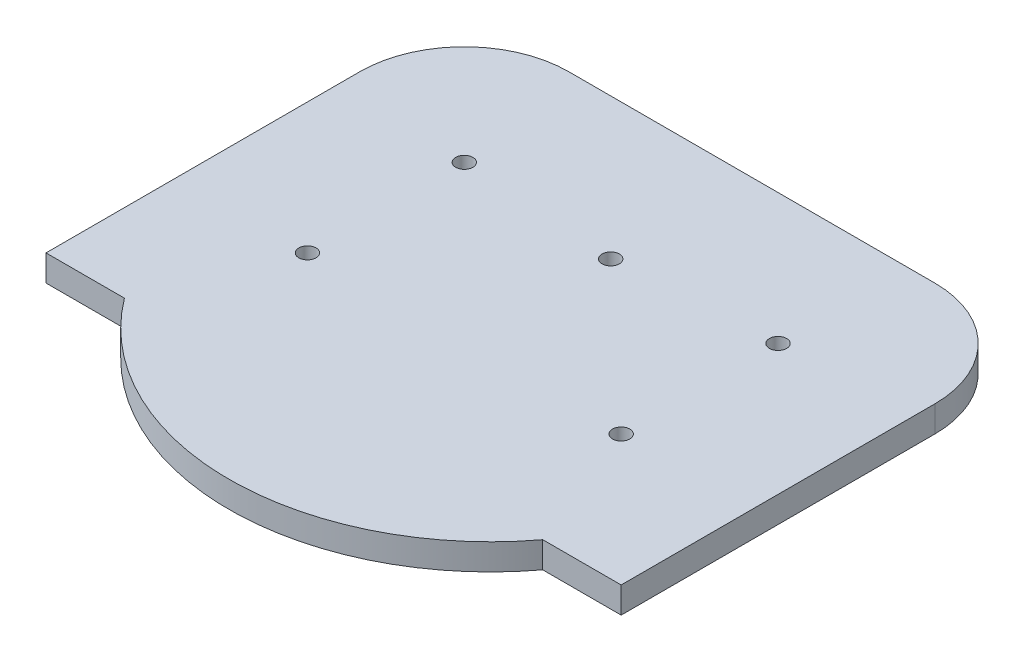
ISO-10303-21;
HEADER;
FILE_DESCRIPTION(('STEP AP214'),'2;1');
FILE_NAME('part.step','',(''),(''),'','','');
FILE_SCHEMA(('AUTOMOTIVE_DESIGN { 1 0 10303 214 1 1 1 1 }'));
ENDSEC;
DATA;
#1=APPLICATION_CONTEXT('core data for automotive mechanical design processes');
#2=APPLICATION_PROTOCOL_DEFINITION('international standard','automotive_design',2000,#1);
#3=PRODUCT_CONTEXT('',#1,'mechanical');
#4=PRODUCT('Part','Part','',(#3));
#5=PRODUCT_RELATED_PRODUCT_CATEGORY('part','',(#4));
#6=PRODUCT_DEFINITION_FORMATION('','',#4);
#7=PRODUCT_DEFINITION_CONTEXT('part definition',#1,'design');
#8=PRODUCT_DEFINITION('design','',#6,#7);
#9=PRODUCT_DEFINITION_SHAPE('','',#8);
#10=(LENGTH_UNIT() NAMED_UNIT(*) SI_UNIT(.MILLI.,.METRE.));
#11=(NAMED_UNIT(*) PLANE_ANGLE_UNIT() SI_UNIT($,.RADIAN.));
#12=(NAMED_UNIT(*) SI_UNIT($,.STERADIAN.) SOLID_ANGLE_UNIT());
#13=UNCERTAINTY_MEASURE_WITH_UNIT(LENGTH_MEASURE(1.E-05),#10,'distance_accuracy_value','');
#14=(GEOMETRIC_REPRESENTATION_CONTEXT(3) GLOBAL_UNCERTAINTY_ASSIGNED_CONTEXT((#13)) GLOBAL_UNIT_ASSIGNED_CONTEXT((#10,
#11,#12)) REPRESENTATION_CONTEXT('',''));
#15=CARTESIAN_POINT('',(0.,0.,0.));
#16=DIRECTION('',(0.,0.,1.));
#17=DIRECTION('',(1.,0.,0.));
#18=AXIS2_PLACEMENT_3D('',#15,#16,#17);
#19=CARTESIAN_POINT('',(20.,0.,-60.));
#20=DIRECTION('',(0.,-1.,0.));
#21=DIRECTION('',(0.,0.,-1.));
#22=AXIS2_PLACEMENT_3D('',#19,#20,#21);
#23=PLANE('',#22);
#24=CARTESIAN_POINT('',(55.,0.,-53.));
#25=DIRECTION('',(0.,1.,0.));
#26=DIRECTION('',(0.,0.,1.));
#27=AXIS2_PLACEMENT_3D('',#24,#25,#26);
#28=CIRCLE('',#27,1.65);
#29=CARTESIAN_POINT('',(55.,0.,-51.35));
#30=VERTEX_POINT('',#29);
#31=EDGE_CURVE('E194',#30,#30,#28,.T.);
#32=ORIENTED_EDGE('',*,*,#31,.T.);
#33=EDGE_LOOP('',(#32));
#34=FACE_BOUND('',#33,.T.);
#35=CARTESIAN_POINT('',(25.,0.,-25.));
#36=DIRECTION('',(0.,1.,0.));
#37=DIRECTION('',(0.,0.,1.));
#38=AXIS2_PLACEMENT_3D('',#35,#36,#37);
#39=CIRCLE('',#38,1.65);
#40=CARTESIAN_POINT('',(25.,0.,-23.35));
#41=VERTEX_POINT('',#40);
#42=EDGE_CURVE('E133',#41,#41,#39,.T.);
#43=ORIENTED_EDGE('',*,*,#42,.T.);
#44=EDGE_LOOP('',(#43));
#45=FACE_BOUND('',#44,.T.);
#46=DIRECTION('',(0.,0.,1.));
#47=VECTOR('',#46,1.);
#48=CARTESIAN_POINT('',(0.,0.,0.));
#49=LINE('',#48,#47);
#50=CARTESIAN_POINT('',(0.,0.,-59.9999999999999));
#51=VERTEX_POINT('',#50);
#52=CARTESIAN_POINT('',(0.,0.,0.));
#53=VERTEX_POINT('',#52);
#54=EDGE_CURVE('E129',#51,#53,#49,.T.);
#55=ORIENTED_EDGE('',*,*,#54,.F.);
#56=CARTESIAN_POINT('',(20.,0.,-60.));
#57=DIRECTION('',(0.,1.,0.));
#58=DIRECTION('',(0.,0.,-1.));
#59=AXIS2_PLACEMENT_3D('',#56,#57,#58);
#60=CIRCLE('',#59,20.);
#61=CARTESIAN_POINT('',(20.0000000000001,0.,-80.));
#62=VERTEX_POINT('',#61);
#63=EDGE_CURVE('E83',#62,#51,#60,.T.);
#64=ORIENTED_EDGE('',*,*,#63,.F.);
#65=DIRECTION('',(-1.,0.,0.));
#66=VECTOR('',#65,1.);
#67=CARTESIAN_POINT('',(20.0000000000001,0.,-80.));
#68=LINE('',#67,#66);
#69=CARTESIAN_POINT('',(89.9999999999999,0.,-80.));
#70=VERTEX_POINT('',#69);
#71=EDGE_CURVE('E77',#70,#62,#68,.T.);
#72=ORIENTED_EDGE('',*,*,#71,.F.);
#73=CARTESIAN_POINT('',(90.,0.,-60.));
#74=DIRECTION('',(0.,1.,0.));
#75=DIRECTION('',(0.,0.,1.));
#76=AXIS2_PLACEMENT_3D('',#73,#74,#75);
#77=CIRCLE('',#76,20.);
#78=CARTESIAN_POINT('',(110.,0.,-59.9999999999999));
#79=VERTEX_POINT('',#78);
#80=EDGE_CURVE('E119',#79,#70,#77,.T.);
#81=ORIENTED_EDGE('',*,*,#80,.F.);
#82=DIRECTION('',(0.,0.,-1.));
#83=VECTOR('',#82,1.);
#84=CARTESIAN_POINT('',(110.,0.,0.));
#85=LINE('',#84,#83);
#86=CARTESIAN_POINT('',(110.,0.,0.));
#87=VERTEX_POINT('',#86);
#88=EDGE_CURVE('E139',#87,#79,#85,.T.);
#89=ORIENTED_EDGE('',*,*,#88,.F.);
#90=DIRECTION('',(1.,0.,0.));
#91=VECTOR('',#90,1.);
#92=CARTESIAN_POINT('',(95.,0.,0.));
#93=LINE('',#92,#91);
#94=CARTESIAN_POINT('',(95.,0.,0.));
#95=VERTEX_POINT('',#94);
#96=EDGE_CURVE('E137',#95,#87,#93,.T.);
#97=ORIENTED_EDGE('',*,*,#96,.F.);
#98=CARTESIAN_POINT('',(55.,0.,-30.));
#99=DIRECTION('',(0.,1.,0.));
#100=DIRECTION('',(0.,0.,1.));
#101=AXIS2_PLACEMENT_3D('',#98,#99,#100);
#102=CIRCLE('',#101,50.);
#103=CARTESIAN_POINT('',(15.,0.,0.));
#104=VERTEX_POINT('',#103);
#105=EDGE_CURVE('E135',#104,#95,#102,.T.);
#106=ORIENTED_EDGE('',*,*,#105,.F.);
#107=DIRECTION('',(1.,0.,0.));
#108=VECTOR('',#107,1.);
#109=CARTESIAN_POINT('',(0.,0.,0.));
#110=LINE('',#109,#108);
#111=EDGE_CURVE('E132',#53,#104,#110,.T.);
#112=ORIENTED_EDGE('',*,*,#111,.F.);
#113=EDGE_LOOP('',(#55,#64,#72,#81,#89,#97,#106,#112));
#114=FACE_BOUND('',#113,.T.);
#115=CARTESIAN_POINT('',(85.,0.,-25.));
#116=DIRECTION('',(0.,1.,0.));
#117=DIRECTION('',(0.,0.,1.));
#118=AXIS2_PLACEMENT_3D('',#115,#116,#117);
#119=CIRCLE('',#118,1.65);
#120=CARTESIAN_POINT('',(85.,0.,-23.35));
#121=VERTEX_POINT('',#120);
#122=EDGE_CURVE('E182',#121,#121,#119,.T.);
#123=ORIENTED_EDGE('',*,*,#122,.T.);
#124=EDGE_LOOP('',(#123));
#125=FACE_BOUND('',#124,.T.);
#126=CARTESIAN_POINT('',(85.,0.,-55.));
#127=DIRECTION('',(0.,1.,0.));
#128=DIRECTION('',(0.,0.,1.));
#129=AXIS2_PLACEMENT_3D('',#126,#127,#128);
#130=CIRCLE('',#129,1.65);
#131=CARTESIAN_POINT('',(85.,0.,-53.35));
#132=VERTEX_POINT('',#131);
#133=EDGE_CURVE('E188',#132,#132,#130,.T.);
#134=ORIENTED_EDGE('',*,*,#133,.T.);
#135=EDGE_LOOP('',(#134));
#136=FACE_BOUND('',#135,.T.);
#137=CARTESIAN_POINT('',(25.,0.,-55.));
#138=DIRECTION('',(0.,1.,0.));
#139=DIRECTION('',(0.,0.,1.));
#140=AXIS2_PLACEMENT_3D('',#137,#138,#139);
#141=CIRCLE('',#140,1.65);
#142=CARTESIAN_POINT('',(25.,0.,-53.35));
#143=VERTEX_POINT('',#142);
#144=EDGE_CURVE('E200',#143,#143,#141,.T.);
#145=ORIENTED_EDGE('',*,*,#144,.T.);
#146=EDGE_LOOP('',(#145));
#147=FACE_BOUND('',#146,.T.);
#148=ADVANCED_FACE('F31',(#34,#45,#114,#125,#136,#147),#23,.T.);
#149=CARTESIAN_POINT('',(20.,5.,-60.));
#150=DIRECTION('',(0.,-1.,0.));
#151=DIRECTION('',(0.,0.,-1.));
#152=AXIS2_PLACEMENT_3D('',#149,#150,#151);
#153=PLANE('',#152);
#154=CARTESIAN_POINT('',(85.,5.,-55.));
#155=DIRECTION('',(0.,1.,0.));
#156=DIRECTION('',(0.,0.,1.));
#157=AXIS2_PLACEMENT_3D('',#154,#155,#156);
#158=CIRCLE('',#157,1.65);
#159=CARTESIAN_POINT('',(85.,5.,-53.35));
#160=VERTEX_POINT('',#159);
#161=EDGE_CURVE('E191',#160,#160,#158,.T.);
#162=ORIENTED_EDGE('',*,*,#161,.F.);
#163=EDGE_LOOP('',(#162));
#164=FACE_BOUND('',#163,.T.);
#165=CARTESIAN_POINT('',(85.,5.,-25.));
#166=DIRECTION('',(0.,1.,0.));
#167=DIRECTION('',(0.,0.,1.));
#168=AXIS2_PLACEMENT_3D('',#165,#166,#167);
#169=CIRCLE('',#168,1.65);
#170=CARTESIAN_POINT('',(85.,5.,-23.35));
#171=VERTEX_POINT('',#170);
#172=EDGE_CURVE('E185',#171,#171,#169,.T.);
#173=ORIENTED_EDGE('',*,*,#172,.F.);
#174=EDGE_LOOP('',(#173));
#175=FACE_BOUND('',#174,.T.);
#176=DIRECTION('',(0.,0.,1.));
#177=VECTOR('',#176,1.);
#178=CARTESIAN_POINT('',(0.,5.,0.));
#179=LINE('',#178,#177);
#180=CARTESIAN_POINT('',(0.,5.,-59.9999999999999));
#181=VERTEX_POINT('',#180);
#182=CARTESIAN_POINT('',(0.,5.,0.));
#183=VERTEX_POINT('',#182);
#184=EDGE_CURVE('E144',#181,#183,#179,.T.);
#185=ORIENTED_EDGE('',*,*,#184,.T.);
#186=DIRECTION('',(1.,0.,0.));
#187=VECTOR('',#186,1.);
#188=CARTESIAN_POINT('',(0.,5.,0.));
#189=LINE('',#188,#187);
#190=CARTESIAN_POINT('',(15.,5.,0.));
#191=VERTEX_POINT('',#190);
#192=EDGE_CURVE('E91',#183,#191,#189,.T.);
#193=ORIENTED_EDGE('',*,*,#192,.T.);
#194=CARTESIAN_POINT('',(55.,5.,-30.));
#195=DIRECTION('',(0.,1.,0.));
#196=DIRECTION('',(0.,0.,1.));
#197=AXIS2_PLACEMENT_3D('',#194,#195,#196);
#198=CIRCLE('',#197,50.);
#199=CARTESIAN_POINT('',(95.,5.,0.));
#200=VERTEX_POINT('',#199);
#201=EDGE_CURVE('E159',#191,#200,#198,.T.);
#202=ORIENTED_EDGE('',*,*,#201,.T.);
#203=DIRECTION('',(1.,0.,0.));
#204=VECTOR('',#203,1.);
#205=CARTESIAN_POINT('',(95.,5.,0.));
#206=LINE('',#205,#204);
#207=CARTESIAN_POINT('',(110.,5.,0.));
#208=VERTEX_POINT('',#207);
#209=EDGE_CURVE('E171',#200,#208,#206,.T.);
#210=ORIENTED_EDGE('',*,*,#209,.T.);
#211=DIRECTION('',(0.,0.,-1.));
#212=VECTOR('',#211,1.);
#213=CARTESIAN_POINT('',(110.,5.,0.));
#214=LINE('',#213,#212);
#215=CARTESIAN_POINT('',(110.,5.,-59.9999999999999));
#216=VERTEX_POINT('',#215);
#217=EDGE_CURVE('E111',#208,#216,#214,.T.);
#218=ORIENTED_EDGE('',*,*,#217,.T.);
#219=CARTESIAN_POINT('',(90.,5.,-60.));
#220=DIRECTION('',(0.,1.,0.));
#221=DIRECTION('',(0.,0.,1.));
#222=AXIS2_PLACEMENT_3D('',#219,#220,#221);
#223=CIRCLE('',#222,20.);
#224=CARTESIAN_POINT('',(89.9999999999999,5.,-80.));
#225=VERTEX_POINT('',#224);
#226=EDGE_CURVE('E104',#216,#225,#223,.T.);
#227=ORIENTED_EDGE('',*,*,#226,.T.);
#228=DIRECTION('',(-1.,0.,0.));
#229=VECTOR('',#228,1.);
#230=CARTESIAN_POINT('',(20.0000000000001,5.,-80.));
#231=LINE('',#230,#229);
#232=CARTESIAN_POINT('',(20.0000000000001,5.,-80.));
#233=VERTEX_POINT('',#232);
#234=EDGE_CURVE('E109',#225,#233,#231,.T.);
#235=ORIENTED_EDGE('',*,*,#234,.T.);
#236=CARTESIAN_POINT('',(20.,5.,-60.));
#237=DIRECTION('',(0.,1.,0.));
#238=DIRECTION('',(0.,0.,-1.));
#239=AXIS2_PLACEMENT_3D('',#236,#237,#238);
#240=CIRCLE('',#239,20.);
#241=EDGE_CURVE('E48',#233,#181,#240,.T.);
#242=ORIENTED_EDGE('',*,*,#241,.T.);
#243=EDGE_LOOP('',(#185,#193,#202,#210,#218,#227,#235,#242));
#244=FACE_BOUND('',#243,.T.);
#245=CARTESIAN_POINT('',(25.,5.,-25.));
#246=DIRECTION('',(0.,1.,0.));
#247=DIRECTION('',(0.,0.,1.));
#248=AXIS2_PLACEMENT_3D('',#245,#246,#247);
#249=CIRCLE('',#248,1.65);
#250=CARTESIAN_POINT('',(25.,5.,-23.35));
#251=VERTEX_POINT('',#250);
#252=EDGE_CURVE('E179',#251,#251,#249,.T.);
#253=ORIENTED_EDGE('',*,*,#252,.F.);
#254=EDGE_LOOP('',(#253));
#255=FACE_BOUND('',#254,.T.);
#256=CARTESIAN_POINT('',(55.,5.,-53.));
#257=DIRECTION('',(0.,1.,0.));
#258=DIRECTION('',(0.,0.,1.));
#259=AXIS2_PLACEMENT_3D('',#256,#257,#258);
#260=CIRCLE('',#259,1.65);
#261=CARTESIAN_POINT('',(55.,5.,-51.35));
#262=VERTEX_POINT('',#261);
#263=EDGE_CURVE('E197',#262,#262,#260,.T.);
#264=ORIENTED_EDGE('',*,*,#263,.F.);
#265=EDGE_LOOP('',(#264));
#266=FACE_BOUND('',#265,.T.);
#267=CARTESIAN_POINT('',(25.,5.,-55.));
#268=DIRECTION('',(0.,1.,0.));
#269=DIRECTION('',(0.,0.,1.));
#270=AXIS2_PLACEMENT_3D('',#267,#268,#269);
#271=CIRCLE('',#270,1.65);
#272=CARTESIAN_POINT('',(25.,5.,-53.35));
#273=VERTEX_POINT('',#272);
#274=EDGE_CURVE('E203',#273,#273,#271,.T.);
#275=ORIENTED_EDGE('',*,*,#274,.F.);
#276=EDGE_LOOP('',(#275));
#277=FACE_BOUND('',#276,.T.);
#278=ADVANCED_FACE('F106',(#164,#175,#244,#255,#266,#277),#153,.F.);
#279=CARTESIAN_POINT('',(0.,5.,0.));
#280=DIRECTION('',(1.,0.,0.));
#281=DIRECTION('',(0.,0.,-1.));
#282=AXIS2_PLACEMENT_3D('',#279,#280,#281);
#283=PLANE('',#282);
#284=ORIENTED_EDGE('',*,*,#54,.T.);
#285=DIRECTION('',(0.,-1.,0.));
#286=VECTOR('',#285,1.);
#287=CARTESIAN_POINT('',(0.,5.,0.));
#288=LINE('',#287,#286);
#289=EDGE_CURVE('E11',#183,#53,#288,.T.);
#290=ORIENTED_EDGE('',*,*,#289,.F.);
#291=ORIENTED_EDGE('',*,*,#184,.F.);
#292=DIRECTION('',(0.,-1.,0.));
#293=VECTOR('',#292,1.);
#294=CARTESIAN_POINT('',(0.,5.,-59.9999999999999));
#295=LINE('',#294,#293);
#296=EDGE_CURVE('E125',#181,#51,#295,.T.);
#297=ORIENTED_EDGE('',*,*,#296,.T.);
#298=EDGE_LOOP('',(#284,#290,#291,#297));
#299=FACE_BOUND('',#298,.T.);
#300=ADVANCED_FACE('F33',(#299),#283,.F.);
#301=CARTESIAN_POINT('',(0.,5.,0.));
#302=DIRECTION('',(0.,0.,-1.));
#303=DIRECTION('',(-1.,0.,0.));
#304=AXIS2_PLACEMENT_3D('',#301,#302,#303);
#305=PLANE('',#304);
#306=ORIENTED_EDGE('',*,*,#111,.T.);
#307=DIRECTION('',(0.,-1.,0.));
#308=VECTOR('',#307,1.);
#309=CARTESIAN_POINT('',(15.,5.,0.));
#310=LINE('',#309,#308);
#311=EDGE_CURVE('E40',#191,#104,#310,.T.);
#312=ORIENTED_EDGE('',*,*,#311,.F.);
#313=ORIENTED_EDGE('',*,*,#192,.F.);
#314=ORIENTED_EDGE('',*,*,#289,.T.);
#315=EDGE_LOOP('',(#306,#312,#313,#314));
#316=FACE_BOUND('',#315,.T.);
#317=ADVANCED_FACE('F216',(#316),#305,.F.);
#318=CARTESIAN_POINT('',(55.,5.,-30.));
#319=DIRECTION('',(0.,-1.,0.));
#320=DIRECTION('',(0.,0.,-1.));
#321=AXIS2_PLACEMENT_3D('',#318,#319,#320);
#322=CYLINDRICAL_SURFACE('',#321,50.);
#323=ORIENTED_EDGE('',*,*,#105,.T.);
#324=DIRECTION('',(0.,-1.,0.));
#325=VECTOR('',#324,1.);
#326=CARTESIAN_POINT('',(95.,5.,0.));
#327=LINE('',#326,#325);
#328=EDGE_CURVE('E151',#200,#95,#327,.T.);
#329=ORIENTED_EDGE('',*,*,#328,.F.);
#330=ORIENTED_EDGE('',*,*,#201,.F.);
#331=ORIENTED_EDGE('',*,*,#311,.T.);
#332=EDGE_LOOP('',(#323,#329,#330,#331));
#333=FACE_BOUND('',#332,.T.);
#334=ADVANCED_FACE('F157',(#333),#322,.T.);
#335=CARTESIAN_POINT('',(95.,5.,0.));
#336=DIRECTION('',(0.,0.,-1.));
#337=DIRECTION('',(-1.,0.,0.));
#338=AXIS2_PLACEMENT_3D('',#335,#336,#337);
#339=PLANE('',#338);
#340=ORIENTED_EDGE('',*,*,#96,.T.);
#341=DIRECTION('',(0.,-1.,0.));
#342=VECTOR('',#341,1.);
#343=CARTESIAN_POINT('',(110.,5.,0.));
#344=LINE('',#343,#342);
#345=EDGE_CURVE('E148',#208,#87,#344,.T.);
#346=ORIENTED_EDGE('',*,*,#345,.F.);
#347=ORIENTED_EDGE('',*,*,#209,.F.);
#348=ORIENTED_EDGE('',*,*,#328,.T.);
#349=EDGE_LOOP('',(#340,#346,#347,#348));
#350=FACE_BOUND('',#349,.T.);
#351=ADVANCED_FACE('F167',(#350),#339,.F.);
#352=CARTESIAN_POINT('',(110.,5.,0.));
#353=DIRECTION('',(-1.,0.,0.));
#354=DIRECTION('',(0.,0.,1.));
#355=AXIS2_PLACEMENT_3D('',#352,#353,#354);
#356=PLANE('',#355);
#357=ORIENTED_EDGE('',*,*,#88,.T.);
#358=DIRECTION('',(0.,-1.,0.));
#359=VECTOR('',#358,1.);
#360=CARTESIAN_POINT('',(110.,5.,-59.9999999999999));
#361=LINE('',#360,#359);
#362=EDGE_CURVE('E120',#216,#79,#361,.T.);
#363=ORIENTED_EDGE('',*,*,#362,.F.);
#364=ORIENTED_EDGE('',*,*,#217,.F.);
#365=ORIENTED_EDGE('',*,*,#345,.T.);
#366=EDGE_LOOP('',(#357,#363,#364,#365));
#367=FACE_BOUND('',#366,.T.);
#368=ADVANCED_FACE('F170',(#367),#356,.F.);
#369=CARTESIAN_POINT('',(90.,5.,-60.));
#370=DIRECTION('',(0.,-1.,0.));
#371=DIRECTION('',(0.,0.,-1.));
#372=AXIS2_PLACEMENT_3D('',#369,#370,#371);
#373=CYLINDRICAL_SURFACE('',#372,20.);
#374=ORIENTED_EDGE('',*,*,#80,.T.);
#375=DIRECTION('',(0.,-1.,0.));
#376=VECTOR('',#375,1.);
#377=CARTESIAN_POINT('',(89.9999999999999,5.,-80.));
#378=LINE('',#377,#376);
#379=EDGE_CURVE('E116',#225,#70,#378,.T.);
#380=ORIENTED_EDGE('',*,*,#379,.F.);
#381=ORIENTED_EDGE('',*,*,#226,.F.);
#382=ORIENTED_EDGE('',*,*,#362,.T.);
#383=EDGE_LOOP('',(#374,#380,#381,#382));
#384=FACE_BOUND('',#383,.T.);
#385=ADVANCED_FACE('F117',(#384),#373,.T.);
#386=CARTESIAN_POINT('',(20.0000000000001,5.,-80.));
#387=DIRECTION('',(0.,0.,1.));
#388=DIRECTION('',(1.,0.,0.));
#389=AXIS2_PLACEMENT_3D('',#386,#387,#388);
#390=PLANE('',#389);
#391=ORIENTED_EDGE('',*,*,#71,.T.);
#392=DIRECTION('',(0.,-1.,0.));
#393=VECTOR('',#392,1.);
#394=CARTESIAN_POINT('',(20.0000000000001,5.,-80.));
#395=LINE('',#394,#393);
#396=EDGE_CURVE('E121',#233,#62,#395,.T.);
#397=ORIENTED_EDGE('',*,*,#396,.F.);
#398=ORIENTED_EDGE('',*,*,#234,.F.);
#399=ORIENTED_EDGE('',*,*,#379,.T.);
#400=EDGE_LOOP('',(#391,#397,#398,#399));
#401=FACE_BOUND('',#400,.T.);
#402=ADVANCED_FACE('F123',(#401),#390,.F.);
#403=CARTESIAN_POINT('',(20.,5.,-60.));
#404=DIRECTION('',(0.,-1.,0.));
#405=DIRECTION('',(0.,0.,-1.));
#406=AXIS2_PLACEMENT_3D('',#403,#404,#405);
#407=CYLINDRICAL_SURFACE('',#406,20.);
#408=ORIENTED_EDGE('',*,*,#63,.T.);
#409=ORIENTED_EDGE('',*,*,#296,.F.);
#410=ORIENTED_EDGE('',*,*,#241,.F.);
#411=ORIENTED_EDGE('',*,*,#396,.T.);
#412=EDGE_LOOP('',(#408,#409,#410,#411));
#413=FACE_BOUND('',#412,.T.);
#414=ADVANCED_FACE('F226',(#413),#407,.T.);
#415=CARTESIAN_POINT('',(25.,5.,-25.));
#416=DIRECTION('',(0.,1.,0.));
#417=DIRECTION('',(0.,0.,1.));
#418=AXIS2_PLACEMENT_3D('',#415,#416,#417);
#419=CYLINDRICAL_SURFACE('',#418,1.65);
#420=ORIENTED_EDGE('',*,*,#42,.F.);
#421=EDGE_LOOP('',(#420));
#422=FACE_BOUND('',#421,.T.);
#423=ORIENTED_EDGE('',*,*,#252,.T.);
#424=EDGE_LOOP('',(#423));
#425=FACE_BOUND('',#424,.T.);
#426=ADVANCED_FACE('F223',(#422,#425),#419,.F.);
#427=CARTESIAN_POINT('',(85.,5.,-25.));
#428=DIRECTION('',(0.,1.,0.));
#429=DIRECTION('',(0.,0.,1.));
#430=AXIS2_PLACEMENT_3D('',#427,#428,#429);
#431=CYLINDRICAL_SURFACE('',#430,1.65);
#432=ORIENTED_EDGE('',*,*,#122,.F.);
#433=EDGE_LOOP('',(#432));
#434=FACE_BOUND('',#433,.T.);
#435=ORIENTED_EDGE('',*,*,#172,.T.);
#436=EDGE_LOOP('',(#435));
#437=FACE_BOUND('',#436,.T.);
#438=ADVANCED_FACE('F276',(#434,#437),#431,.F.);
#439=CARTESIAN_POINT('',(85.,5.,-55.));
#440=DIRECTION('',(0.,1.,0.));
#441=DIRECTION('',(0.,0.,1.));
#442=AXIS2_PLACEMENT_3D('',#439,#440,#441);
#443=CYLINDRICAL_SURFACE('',#442,1.65);
#444=ORIENTED_EDGE('',*,*,#133,.F.);
#445=EDGE_LOOP('',(#444));
#446=FACE_BOUND('',#445,.T.);
#447=ORIENTED_EDGE('',*,*,#161,.T.);
#448=EDGE_LOOP('',(#447));
#449=FACE_BOUND('',#448,.T.);
#450=ADVANCED_FACE('F283',(#446,#449),#443,.F.);
#451=CARTESIAN_POINT('',(55.,5.,-53.));
#452=DIRECTION('',(0.,1.,0.));
#453=DIRECTION('',(0.,0.,1.));
#454=AXIS2_PLACEMENT_3D('',#451,#452,#453);
#455=CYLINDRICAL_SURFACE('',#454,1.65);
#456=ORIENTED_EDGE('',*,*,#31,.F.);
#457=EDGE_LOOP('',(#456));
#458=FACE_BOUND('',#457,.T.);
#459=ORIENTED_EDGE('',*,*,#263,.T.);
#460=EDGE_LOOP('',(#459));
#461=FACE_BOUND('',#460,.T.);
#462=ADVANCED_FACE('F290',(#458,#461),#455,.F.);
#463=CARTESIAN_POINT('',(25.,5.,-55.));
#464=DIRECTION('',(0.,1.,0.));
#465=DIRECTION('',(0.,0.,1.));
#466=AXIS2_PLACEMENT_3D('',#463,#464,#465);
#467=CYLINDRICAL_SURFACE('',#466,1.65);
#468=ORIENTED_EDGE('',*,*,#144,.F.);
#469=EDGE_LOOP('',(#468));
#470=FACE_BOUND('',#469,.T.);
#471=ORIENTED_EDGE('',*,*,#274,.T.);
#472=EDGE_LOOP('',(#471));
#473=FACE_BOUND('',#472,.T.);
#474=ADVANCED_FACE('F207',(#470,#473),#467,.F.);
#475=CLOSED_SHELL('',(#148,#278,#300,#317,#334,#351,#368,#385,#402,#414,#426,#438,#450,#462,#474));
#476=MANIFOLD_SOLID_BREP('B2',#475);
#477=ADVANCED_BREP_SHAPE_REPRESENTATION('',(#18,#476),#14);
#478=SHAPE_DEFINITION_REPRESENTATION(#9,#477);
ENDSEC;
END-ISO-10303-21;
